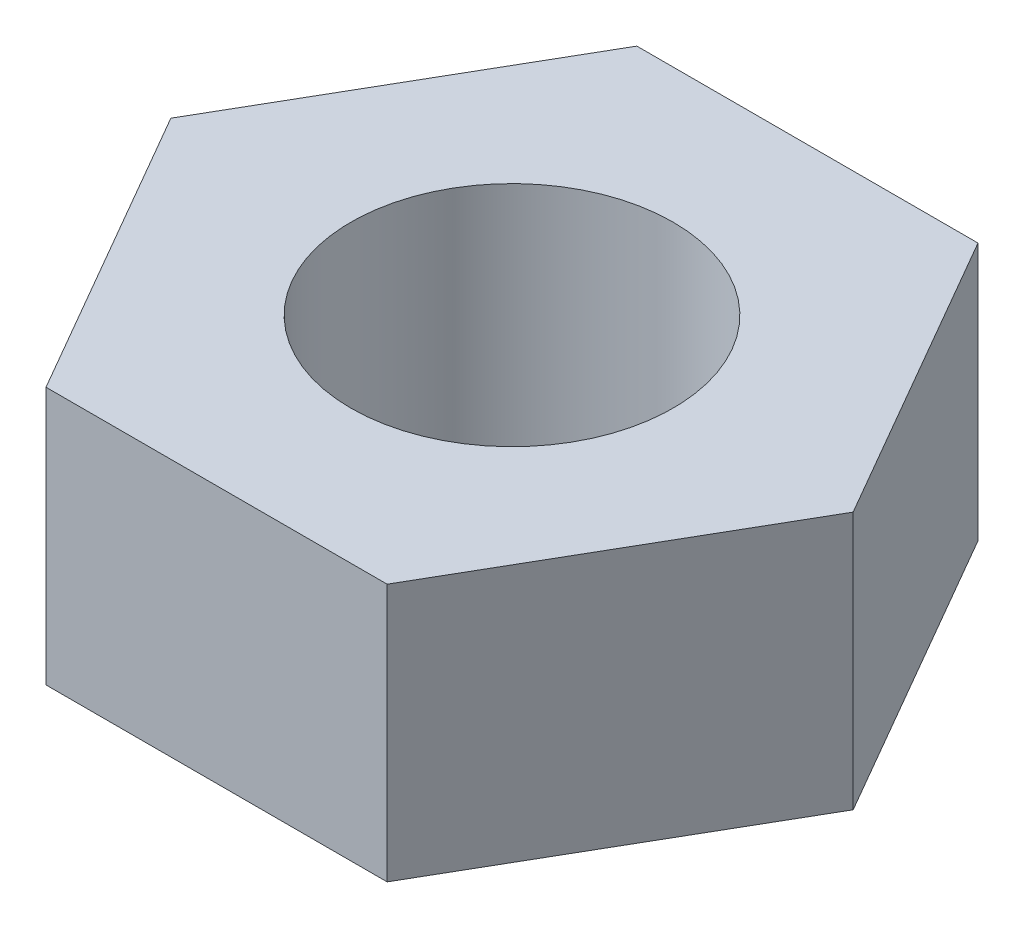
from build123d import *

# Parameters (mm, degrees)
SKETCH1_R      = 1.5
EXTRUDE1_DEPTH = 2.4


with BuildPart() as part:
    # Sketch1 → Extrude1 (new body)
    with BuildSketch(Plane(origin=(0, 0, 0), x_dir=(1, 0, 0), z_dir=(0, 1, 0))):
        Polygon((1.58771324, -2.75), (3.175426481, 0), (1.58771324, 2.75), (-1.58771324, 2.75), (-3.175426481, 0), (-1.58771324, -2.75), align=None)
        with Locations(Location((0, 0, 0), (0, 0, 270))):
            Circle(SKETCH1_R, mode=Mode.SUBTRACT)
    extrude(amount=EXTRUDE1_DEPTH)


solid = part.part
